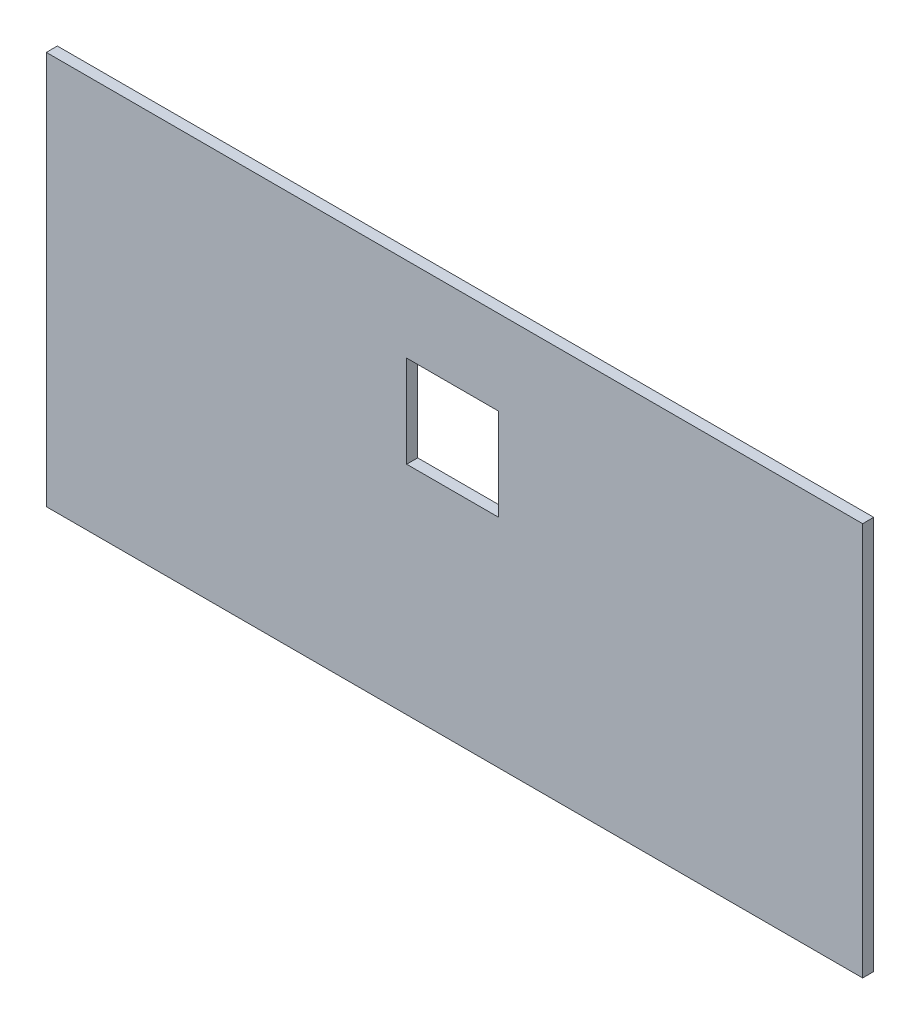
ISO-10303-21;
HEADER;
FILE_DESCRIPTION(('STEP AP214'),'2;1');
FILE_NAME('part.step','',(''),(''),'','','');
FILE_SCHEMA(('AUTOMOTIVE_DESIGN { 1 0 10303 214 1 1 1 1 }'));
ENDSEC;
DATA;
#1=APPLICATION_CONTEXT('core data for automotive mechanical design processes');
#2=APPLICATION_PROTOCOL_DEFINITION('international standard','automotive_design',2000,#1);
#3=PRODUCT_CONTEXT('',#1,'mechanical');
#4=PRODUCT('Part','Part','',(#3));
#5=PRODUCT_RELATED_PRODUCT_CATEGORY('part','',(#4));
#6=PRODUCT_DEFINITION_FORMATION('','',#4);
#7=PRODUCT_DEFINITION_CONTEXT('part definition',#1,'design');
#8=PRODUCT_DEFINITION('design','',#6,#7);
#9=PRODUCT_DEFINITION_SHAPE('','',#8);
#10=(LENGTH_UNIT() NAMED_UNIT(*) SI_UNIT(.MILLI.,.METRE.));
#11=(NAMED_UNIT(*) PLANE_ANGLE_UNIT() SI_UNIT($,.RADIAN.));
#12=(NAMED_UNIT(*) SI_UNIT($,.STERADIAN.) SOLID_ANGLE_UNIT());
#13=UNCERTAINTY_MEASURE_WITH_UNIT(LENGTH_MEASURE(1.E-05),#10,'distance_accuracy_value','');
#14=(GEOMETRIC_REPRESENTATION_CONTEXT(3) GLOBAL_UNCERTAINTY_ASSIGNED_CONTEXT((#13)) GLOBAL_UNIT_ASSIGNED_CONTEXT((#10,
#11,#12)) REPRESENTATION_CONTEXT('',''));
#15=CARTESIAN_POINT('',(0.,0.,0.));
#16=DIRECTION('',(0.,0.,1.));
#17=DIRECTION('',(1.,0.,0.));
#18=AXIS2_PLACEMENT_3D('',#15,#16,#17);
#19=CARTESIAN_POINT('',(0.,0.,3.));
#20=DIRECTION('',(1.,0.,0.));
#21=DIRECTION('',(0.,0.,-1.));
#22=AXIS2_PLACEMENT_3D('',#19,#20,#21);
#23=PLANE('',#22);
#24=DIRECTION('',(0.,-1.,0.));
#25=VECTOR('',#24,1.);
#26=CARTESIAN_POINT('',(0.,0.,0.));
#27=LINE('',#26,#25);
#28=CARTESIAN_POINT('',(0.,107.,0.));
#29=VERTEX_POINT('',#28);
#30=CARTESIAN_POINT('',(0.,0.,0.));
#31=VERTEX_POINT('',#30);
#32=EDGE_CURVE('E128',#29,#31,#27,.T.);
#33=ORIENTED_EDGE('',*,*,#32,.T.);
#34=DIRECTION('',(0.,0.,-1.));
#35=VECTOR('',#34,1.);
#36=CARTESIAN_POINT('',(0.,0.,3.));
#37=LINE('',#36,#35);
#38=CARTESIAN_POINT('',(0.,0.,3.));
#39=VERTEX_POINT('',#38);
#40=EDGE_CURVE('E11',#39,#31,#37,.T.);
#41=ORIENTED_EDGE('',*,*,#40,.F.);
#42=DIRECTION('',(0.,-1.,0.));
#43=VECTOR('',#42,1.);
#44=CARTESIAN_POINT('',(0.,0.,3.));
#45=LINE('',#44,#43);
#46=CARTESIAN_POINT('',(0.,107.,3.));
#47=VERTEX_POINT('',#46);
#48=EDGE_CURVE('E132',#47,#39,#45,.T.);
#49=ORIENTED_EDGE('',*,*,#48,.F.);
#50=DIRECTION('',(0.,0.,-1.));
#51=VECTOR('',#50,1.);
#52=CARTESIAN_POINT('',(0.,107.,3.));
#53=LINE('',#52,#51);
#54=EDGE_CURVE('E142',#47,#29,#53,.T.);
#55=ORIENTED_EDGE('',*,*,#54,.T.);
#56=EDGE_LOOP('',(#33,#41,#49,#55));
#57=FACE_BOUND('',#56,.T.);
#58=ADVANCED_FACE('F31',(#57),#23,.F.);
#59=CARTESIAN_POINT('',(0.,0.,3.));
#60=DIRECTION('',(0.,1.,0.));
#61=DIRECTION('',(0.,0.,1.));
#62=AXIS2_PLACEMENT_3D('',#59,#60,#61);
#63=PLANE('',#62);
#64=DIRECTION('',(1.,0.,0.));
#65=VECTOR('',#64,1.);
#66=CARTESIAN_POINT('',(0.,0.,0.));
#67=LINE('',#66,#65);
#68=CARTESIAN_POINT('',(222.,0.,0.));
#69=VERTEX_POINT('',#68);
#70=EDGE_CURVE('E145',#31,#69,#67,.T.);
#71=ORIENTED_EDGE('',*,*,#70,.T.);
#72=DIRECTION('',(0.,0.,-1.));
#73=VECTOR('',#72,1.);
#74=CARTESIAN_POINT('',(222.,0.,3.));
#75=LINE('',#74,#73);
#76=CARTESIAN_POINT('',(222.,0.,3.));
#77=VERTEX_POINT('',#76);
#78=EDGE_CURVE('E38',#77,#69,#75,.T.);
#79=ORIENTED_EDGE('',*,*,#78,.F.);
#80=DIRECTION('',(1.,0.,0.));
#81=VECTOR('',#80,1.);
#82=CARTESIAN_POINT('',(0.,0.,3.));
#83=LINE('',#82,#81);
#84=EDGE_CURVE('E135',#39,#77,#83,.T.);
#85=ORIENTED_EDGE('',*,*,#84,.F.);
#86=ORIENTED_EDGE('',*,*,#40,.T.);
#87=EDGE_LOOP('',(#71,#79,#85,#86));
#88=FACE_BOUND('',#87,.T.);
#89=ADVANCED_FACE('F173',(#88),#63,.F.);
#90=CARTESIAN_POINT('',(222.,0.,3.));
#91=DIRECTION('',(-1.,0.,0.));
#92=DIRECTION('',(0.,0.,1.));
#93=AXIS2_PLACEMENT_3D('',#90,#91,#92);
#94=PLANE('',#93);
#95=DIRECTION('',(0.,1.,0.));
#96=VECTOR('',#95,1.);
#97=CARTESIAN_POINT('',(222.,0.,0.));
#98=LINE('',#97,#96);
#99=CARTESIAN_POINT('',(222.,107.,0.));
#100=VERTEX_POINT('',#99);
#101=EDGE_CURVE('E147',#69,#100,#98,.T.);
#102=ORIENTED_EDGE('',*,*,#101,.T.);
#103=DIRECTION('',(0.,0.,-1.));
#104=VECTOR('',#103,1.);
#105=CARTESIAN_POINT('',(222.,107.,3.));
#106=LINE('',#105,#104);
#107=CARTESIAN_POINT('',(222.,107.,3.));
#108=VERTEX_POINT('',#107);
#109=EDGE_CURVE('E152',#108,#100,#106,.T.);
#110=ORIENTED_EDGE('',*,*,#109,.F.);
#111=DIRECTION('',(0.,1.,0.));
#112=VECTOR('',#111,1.);
#113=CARTESIAN_POINT('',(222.,0.,3.));
#114=LINE('',#113,#112);
#115=EDGE_CURVE('E138',#77,#108,#114,.T.);
#116=ORIENTED_EDGE('',*,*,#115,.F.);
#117=ORIENTED_EDGE('',*,*,#78,.T.);
#118=EDGE_LOOP('',(#102,#110,#116,#117));
#119=FACE_BOUND('',#118,.T.);
#120=ADVANCED_FACE('F159',(#119),#94,.F.);
#121=CARTESIAN_POINT('',(0.,107.,3.));
#122=DIRECTION('',(0.,-1.,0.));
#123=DIRECTION('',(0.,0.,-1.));
#124=AXIS2_PLACEMENT_3D('',#121,#122,#123);
#125=PLANE('',#124);
#126=DIRECTION('',(-1.,0.,0.));
#127=VECTOR('',#126,1.);
#128=CARTESIAN_POINT('',(0.,107.,0.));
#129=LINE('',#128,#127);
#130=EDGE_CURVE('E136',#100,#29,#129,.T.);
#131=ORIENTED_EDGE('',*,*,#130,.T.);
#132=ORIENTED_EDGE('',*,*,#54,.F.);
#133=DIRECTION('',(-1.,0.,0.));
#134=VECTOR('',#133,1.);
#135=CARTESIAN_POINT('',(0.,107.,3.));
#136=LINE('',#135,#134);
#137=EDGE_CURVE('E140',#108,#47,#136,.T.);
#138=ORIENTED_EDGE('',*,*,#137,.F.);
#139=ORIENTED_EDGE('',*,*,#109,.T.);
#140=EDGE_LOOP('',(#131,#132,#138,#139));
#141=FACE_BOUND('',#140,.T.);
#142=ADVANCED_FACE('F166',(#141),#125,.F.);
#143=CARTESIAN_POINT('',(0.,107.,3.));
#144=DIRECTION('',(0.,0.,-1.));
#145=DIRECTION('',(-1.,0.,0.));
#146=AXIS2_PLACEMENT_3D('',#143,#144,#145);
#147=PLANE('',#146);
#148=DIRECTION('',(1.,0.,0.));
#149=VECTOR('',#148,1.);
#150=CARTESIAN_POINT('',(98.,59.,3.));
#151=LINE('',#150,#149);
#152=CARTESIAN_POINT('',(98.,59.,3.));
#153=VERTEX_POINT('',#152);
#154=CARTESIAN_POINT('',(123.,59.,3.));
#155=VERTEX_POINT('',#154);
#156=EDGE_CURVE('E122',#153,#155,#151,.T.);
#157=ORIENTED_EDGE('',*,*,#156,.F.);
#158=DIRECTION('',(0.,-1.,0.));
#159=VECTOR('',#158,1.);
#160=CARTESIAN_POINT('',(98.,59.,3.));
#161=LINE('',#160,#159);
#162=CARTESIAN_POINT('',(98.,84.,3.));
#163=VERTEX_POINT('',#162);
#164=EDGE_CURVE('E45',#163,#153,#161,.T.);
#165=ORIENTED_EDGE('',*,*,#164,.F.);
#166=DIRECTION('',(-1.,0.,0.));
#167=VECTOR('',#166,1.);
#168=CARTESIAN_POINT('',(98.,84.,3.));
#169=LINE('',#168,#167);
#170=CARTESIAN_POINT('',(123.,84.,3.));
#171=VERTEX_POINT('',#170);
#172=EDGE_CURVE('E113',#171,#163,#169,.T.);
#173=ORIENTED_EDGE('',*,*,#172,.F.);
#174=DIRECTION('',(0.,1.,0.));
#175=VECTOR('',#174,1.);
#176=CARTESIAN_POINT('',(123.,59.,3.));
#177=LINE('',#176,#175);
#178=EDGE_CURVE('E116',#155,#171,#177,.T.);
#179=ORIENTED_EDGE('',*,*,#178,.F.);
#180=EDGE_LOOP('',(#157,#165,#173,#179));
#181=FACE_BOUND('',#180,.T.);
#182=ORIENTED_EDGE('',*,*,#48,.T.);
#183=ORIENTED_EDGE('',*,*,#84,.T.);
#184=ORIENTED_EDGE('',*,*,#115,.T.);
#185=ORIENTED_EDGE('',*,*,#137,.T.);
#186=EDGE_LOOP('',(#182,#183,#184,#185));
#187=FACE_BOUND('',#186,.T.);
#188=ADVANCED_FACE('F172',(#181,#187),#147,.F.);
#189=CARTESIAN_POINT('',(0.,107.,0.));
#190=DIRECTION('',(0.,0.,-1.));
#191=DIRECTION('',(-1.,0.,0.));
#192=AXIS2_PLACEMENT_3D('',#189,#190,#191);
#193=PLANE('',#192);
#194=DIRECTION('',(0.,-1.,0.));
#195=VECTOR('',#194,1.);
#196=CARTESIAN_POINT('',(98.,59.,0.));
#197=LINE('',#196,#195);
#198=CARTESIAN_POINT('',(98.,84.,0.));
#199=VERTEX_POINT('',#198);
#200=CARTESIAN_POINT('',(98.,59.,0.));
#201=VERTEX_POINT('',#200);
#202=EDGE_CURVE('E97',#199,#201,#197,.T.);
#203=ORIENTED_EDGE('',*,*,#202,.T.);
#204=DIRECTION('',(1.,0.,0.));
#205=VECTOR('',#204,1.);
#206=CARTESIAN_POINT('',(98.,59.,0.));
#207=LINE('',#206,#205);
#208=CARTESIAN_POINT('',(123.,59.,0.));
#209=VERTEX_POINT('',#208);
#210=EDGE_CURVE('E106',#201,#209,#207,.T.);
#211=ORIENTED_EDGE('',*,*,#210,.T.);
#212=DIRECTION('',(0.,1.,0.));
#213=VECTOR('',#212,1.);
#214=CARTESIAN_POINT('',(123.,59.,0.));
#215=LINE('',#214,#213);
#216=CARTESIAN_POINT('',(123.,84.,0.));
#217=VERTEX_POINT('',#216);
#218=EDGE_CURVE('E53',#209,#217,#215,.T.);
#219=ORIENTED_EDGE('',*,*,#218,.T.);
#220=DIRECTION('',(-1.,0.,0.));
#221=VECTOR('',#220,1.);
#222=CARTESIAN_POINT('',(98.,84.,0.));
#223=LINE('',#222,#221);
#224=EDGE_CURVE('E103',#217,#199,#223,.T.);
#225=ORIENTED_EDGE('',*,*,#224,.T.);
#226=EDGE_LOOP('',(#203,#211,#219,#225));
#227=FACE_BOUND('',#226,.T.);
#228=ORIENTED_EDGE('',*,*,#32,.F.);
#229=ORIENTED_EDGE('',*,*,#130,.F.);
#230=ORIENTED_EDGE('',*,*,#101,.F.);
#231=ORIENTED_EDGE('',*,*,#70,.F.);
#232=EDGE_LOOP('',(#228,#229,#230,#231));
#233=FACE_BOUND('',#232,.T.);
#234=ADVANCED_FACE('F110',(#227,#233),#193,.T.);
#235=CARTESIAN_POINT('',(98.,59.,0.));
#236=DIRECTION('',(-1.,0.,0.));
#237=DIRECTION('',(0.,0.,1.));
#238=AXIS2_PLACEMENT_3D('',#235,#236,#237);
#239=PLANE('',#238);
#240=ORIENTED_EDGE('',*,*,#164,.T.);
#241=DIRECTION('',(0.,0.,1.));
#242=VECTOR('',#241,1.);
#243=CARTESIAN_POINT('',(98.,59.,0.));
#244=LINE('',#243,#242);
#245=EDGE_CURVE('E93',#201,#153,#244,.T.);
#246=ORIENTED_EDGE('',*,*,#245,.F.);
#247=ORIENTED_EDGE('',*,*,#202,.F.);
#248=DIRECTION('',(0.,0.,1.));
#249=VECTOR('',#248,1.);
#250=CARTESIAN_POINT('',(98.,84.,0.));
#251=LINE('',#250,#249);
#252=EDGE_CURVE('E126',#199,#163,#251,.T.);
#253=ORIENTED_EDGE('',*,*,#252,.T.);
#254=EDGE_LOOP('',(#240,#246,#247,#253));
#255=FACE_BOUND('',#254,.T.);
#256=ADVANCED_FACE('F95',(#255),#239,.F.);
#257=CARTESIAN_POINT('',(98.,84.,0.));
#258=DIRECTION('',(0.,1.,0.));
#259=DIRECTION('',(0.,0.,1.));
#260=AXIS2_PLACEMENT_3D('',#257,#258,#259);
#261=PLANE('',#260);
#262=ORIENTED_EDGE('',*,*,#172,.T.);
#263=ORIENTED_EDGE('',*,*,#252,.F.);
#264=ORIENTED_EDGE('',*,*,#224,.F.);
#265=DIRECTION('',(0.,0.,1.));
#266=VECTOR('',#265,1.);
#267=CARTESIAN_POINT('',(123.,84.,0.));
#268=LINE('',#267,#266);
#269=EDGE_CURVE('E129',#217,#171,#268,.T.);
#270=ORIENTED_EDGE('',*,*,#269,.T.);
#271=EDGE_LOOP('',(#262,#263,#264,#270));
#272=FACE_BOUND('',#271,.T.);
#273=ADVANCED_FACE('F190',(#272),#261,.F.);
#274=CARTESIAN_POINT('',(123.,59.,0.));
#275=DIRECTION('',(1.,0.,0.));
#276=DIRECTION('',(0.,0.,-1.));
#277=AXIS2_PLACEMENT_3D('',#274,#275,#276);
#278=PLANE('',#277);
#279=ORIENTED_EDGE('',*,*,#178,.T.);
#280=ORIENTED_EDGE('',*,*,#269,.F.);
#281=ORIENTED_EDGE('',*,*,#218,.F.);
#282=DIRECTION('',(0.,0.,1.));
#283=VECTOR('',#282,1.);
#284=CARTESIAN_POINT('',(123.,59.,0.));
#285=LINE('',#284,#283);
#286=EDGE_CURVE('E102',#209,#155,#285,.T.);
#287=ORIENTED_EDGE('',*,*,#286,.T.);
#288=EDGE_LOOP('',(#279,#280,#281,#287));
#289=FACE_BOUND('',#288,.T.);
#290=ADVANCED_FACE('F193',(#289),#278,.F.);
#291=CARTESIAN_POINT('',(98.,59.,0.));
#292=DIRECTION('',(0.,-1.,0.));
#293=DIRECTION('',(0.,0.,-1.));
#294=AXIS2_PLACEMENT_3D('',#291,#292,#293);
#295=PLANE('',#294);
#296=ORIENTED_EDGE('',*,*,#156,.T.);
#297=ORIENTED_EDGE('',*,*,#286,.F.);
#298=ORIENTED_EDGE('',*,*,#210,.F.);
#299=ORIENTED_EDGE('',*,*,#245,.T.);
#300=EDGE_LOOP('',(#296,#297,#298,#299));
#301=FACE_BOUND('',#300,.T.);
#302=ADVANCED_FACE('F107',(#301),#295,.F.);
#303=CLOSED_SHELL('',(#58,#89,#120,#142,#188,#234,#256,#273,#290,#302));
#304=MANIFOLD_SOLID_BREP('B2',#303);
#305=ADVANCED_BREP_SHAPE_REPRESENTATION('',(#18,#304),#14);
#306=SHAPE_DEFINITION_REPRESENTATION(#9,#305);
ENDSEC;
END-ISO-10303-21;
